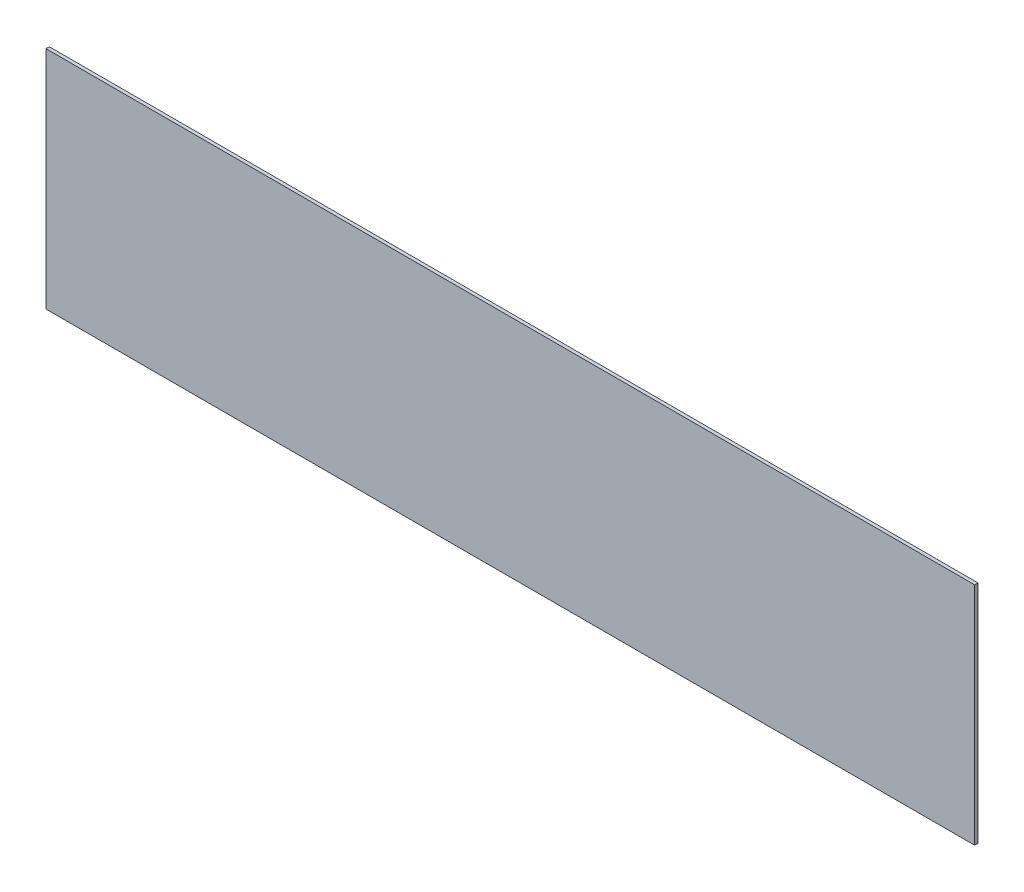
from build123d import *

# Parameters (mm, degrees)
SKETCH2_W           = 1778
SKETCH2_H           = 431.8
BOSS_EXTRUDE1_DEPTH = 6.35


with BuildPart() as part:
    # Sketch2 → Boss-Extrude1 (new body)
    with BuildSketch(Plane.XY):
        with Locations((89.945882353, 330.050588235)):
            Rectangle(SKETCH2_W, SKETCH2_H)
    extrude(amount=BOSS_EXTRUDE1_DEPTH)


solid = part.part
